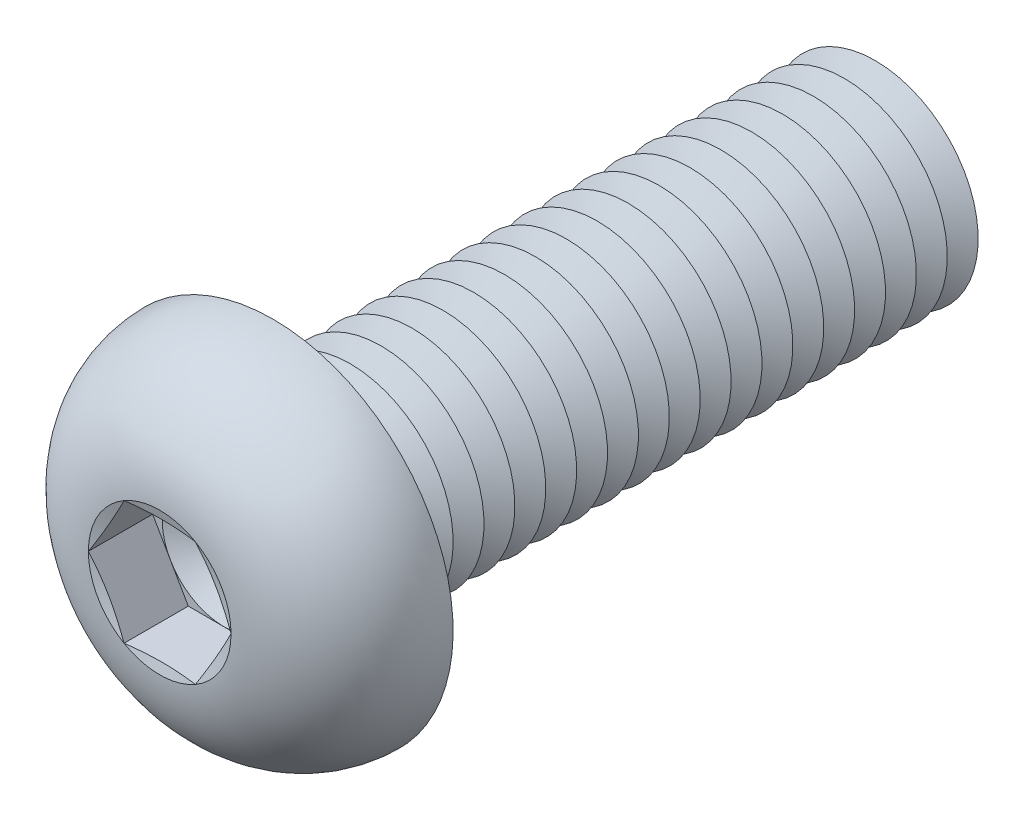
ISO-10303-21;
HEADER;
FILE_DESCRIPTION(('STEP AP214'),'2;1');
FILE_NAME('part.step','',(''),(''),'','','');
FILE_SCHEMA(('AUTOMOTIVE_DESIGN { 1 0 10303 214 1 1 1 1 }'));
ENDSEC;
DATA;
#1=APPLICATION_CONTEXT('core data for automotive mechanical design processes');
#2=APPLICATION_PROTOCOL_DEFINITION('international standard','automotive_design',2000,#1);
#3=PRODUCT_CONTEXT('',#1,'mechanical');
#4=PRODUCT('Part','Part','',(#3));
#5=PRODUCT_RELATED_PRODUCT_CATEGORY('part','',(#4));
#6=PRODUCT_DEFINITION_FORMATION('','',#4);
#7=PRODUCT_DEFINITION_CONTEXT('part definition',#1,'design');
#8=PRODUCT_DEFINITION('design','',#6,#7);
#9=PRODUCT_DEFINITION_SHAPE('','',#8);
#10=(LENGTH_UNIT() NAMED_UNIT(*) SI_UNIT(.MILLI.,.METRE.));
#11=(NAMED_UNIT(*) PLANE_ANGLE_UNIT() SI_UNIT($,.RADIAN.));
#12=(NAMED_UNIT(*) SI_UNIT($,.STERADIAN.) SOLID_ANGLE_UNIT());
#13=UNCERTAINTY_MEASURE_WITH_UNIT(LENGTH_MEASURE(1.E-05),#10,'distance_accuracy_value','');
#14=(GEOMETRIC_REPRESENTATION_CONTEXT(3) GLOBAL_UNCERTAINTY_ASSIGNED_CONTEXT((#13)) GLOBAL_UNIT_ASSIGNED_CONTEXT((#10,
#11,#12)) REPRESENTATION_CONTEXT('',''));
#15=CARTESIAN_POINT('',(0.,0.,0.));
#16=DIRECTION('',(0.,0.,1.));
#17=DIRECTION('',(1.,0.,0.));
#18=AXIS2_PLACEMENT_3D('',#15,#16,#17);
#19=CARTESIAN_POINT('',(0.,0.,2.38));
#20=DIRECTION('',(0.,0.,1.));
#21=DIRECTION('',(1.,0.,0.));
#22=AXIS2_PLACEMENT_3D('',#19,#20,#21);
#23=PLANE('',#22);
#24=CARTESIAN_POINT('',(0.,0.,2.38));
#25=DIRECTION('',(0.,0.,1.));
#26=DIRECTION('',(1.,0.,0.));
#27=AXIS2_PLACEMENT_3D('',#24,#25,#26);
#28=CIRCLE('',#27,2.99999860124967);
#29=CARTESIAN_POINT('',(2.598075,1.49999930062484,2.38));
#30=VERTEX_POINT('',#29);
#31=CARTESIAN_POINT('',(0.,2.99999860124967,2.38));
#32=VERTEX_POINT('',#31);
#33=EDGE_CURVE('E118',#30,#32,#28,.T.);
#34=ORIENTED_EDGE('',*,*,#33,.F.);
#35=DIRECTION('',(-0.500000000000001,0.866025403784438,0.));
#36=VECTOR('',#35,1.);
#37=CARTESIAN_POINT('',(3.4641,0.,2.38));
#38=LINE('',#37,#36);
#39=CARTESIAN_POINT('',(1.73205,2.99999860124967,2.38));
#40=VERTEX_POINT('',#39);
#41=EDGE_CURVE('E125',#30,#40,#38,.T.);
#42=ORIENTED_EDGE('',*,*,#41,.T.);
#43=DIRECTION('',(-1.,0.,0.));
#44=VECTOR('',#43,1.);
#45=CARTESIAN_POINT('',(1.73205,2.99999860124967,2.38));
#46=LINE('',#45,#44);
#47=EDGE_CURVE('E136',#40,#32,#46,.T.);
#48=ORIENTED_EDGE('',*,*,#47,.T.);
#49=EDGE_LOOP('',(#34,#42,#48));
#50=FACE_BOUND('',#49,.T.);
#51=ADVANCED_FACE('F39',(#50),#23,.T.);
#52=CARTESIAN_POINT('',(0.,0.,2.38));
#53=DIRECTION('',(0.,0.,1.));
#54=DIRECTION('',(1.,0.,0.));
#55=AXIS2_PLACEMENT_3D('',#52,#53,#54);
#56=CIRCLE('',#55,2.99999860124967);
#57=CARTESIAN_POINT('',(-2.598075,1.49999930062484,2.38));
#58=VERTEX_POINT('',#57);
#59=EDGE_CURVE('E11',#32,#58,#56,.T.);
#60=ORIENTED_EDGE('',*,*,#59,.F.);
#61=CARTESIAN_POINT('',(-1.73205,2.99999860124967,2.38));
#62=VERTEX_POINT('',#61);
#63=EDGE_CURVE('E131',#32,#62,#46,.T.);
#64=ORIENTED_EDGE('',*,*,#63,.T.);
#65=DIRECTION('',(-0.5,-0.866025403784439,0.));
#66=VECTOR('',#65,1.);
#67=CARTESIAN_POINT('',(-1.73205,2.99999860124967,2.38));
#68=LINE('',#67,#66);
#69=EDGE_CURVE('E134',#62,#58,#68,.T.);
#70=ORIENTED_EDGE('',*,*,#69,.T.);
#71=EDGE_LOOP('',(#60,#64,#70));
#72=FACE_BOUND('',#71,.T.);
#73=ADVANCED_FACE('F130',(#72),#23,.T.);
#74=CARTESIAN_POINT('',(-2.598075,-1.49999930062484,2.38));
#75=VERTEX_POINT('',#74);
#76=EDGE_CURVE('E49',#58,#75,#56,.T.);
#77=ORIENTED_EDGE('',*,*,#76,.F.);
#78=CARTESIAN_POINT('',(-3.4641,0.,2.38));
#79=VERTEX_POINT('',#78);
#80=EDGE_CURVE('E143',#58,#79,#68,.T.);
#81=ORIENTED_EDGE('',*,*,#80,.T.);
#82=DIRECTION('',(0.5,-0.866025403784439,0.));
#83=VECTOR('',#82,1.);
#84=CARTESIAN_POINT('',(-3.4641,0.,2.38));
#85=LINE('',#84,#83);
#86=EDGE_CURVE('E152',#79,#75,#85,.T.);
#87=ORIENTED_EDGE('',*,*,#86,.T.);
#88=EDGE_LOOP('',(#77,#81,#87));
#89=FACE_BOUND('',#88,.T.);
#90=ADVANCED_FACE('F453',(#89),#23,.T.);
#91=CARTESIAN_POINT('',(0.,-2.99999860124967,2.38));
#92=VERTEX_POINT('',#91);
#93=EDGE_CURVE('E356',#75,#92,#56,.T.);
#94=ORIENTED_EDGE('',*,*,#93,.F.);
#95=CARTESIAN_POINT('',(-1.73205,-2.99999860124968,2.38));
#96=VERTEX_POINT('',#95);
#97=EDGE_CURVE('E151',#75,#96,#85,.T.);
#98=ORIENTED_EDGE('',*,*,#97,.T.);
#99=DIRECTION('',(1.,0.,0.));
#100=VECTOR('',#99,1.);
#101=CARTESIAN_POINT('',(-1.73205,-2.99999860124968,2.38));
#102=LINE('',#101,#100);
#103=EDGE_CURVE('E157',#96,#92,#102,.T.);
#104=ORIENTED_EDGE('',*,*,#103,.T.);
#105=EDGE_LOOP('',(#94,#98,#104));
#106=FACE_BOUND('',#105,.T.);
#107=ADVANCED_FACE('F460',(#106),#23,.T.);
#108=CARTESIAN_POINT('',(2.598075,-1.49999930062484,2.38));
#109=VERTEX_POINT('',#108);
#110=EDGE_CURVE('E56',#92,#109,#56,.T.);
#111=ORIENTED_EDGE('',*,*,#110,.F.);
#112=CARTESIAN_POINT('',(1.73205,-2.99999860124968,2.38));
#113=VERTEX_POINT('',#112);
#114=EDGE_CURVE('E156',#92,#113,#102,.T.);
#115=ORIENTED_EDGE('',*,*,#114,.T.);
#116=DIRECTION('',(0.5,0.866025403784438,0.));
#117=VECTOR('',#116,1.);
#118=CARTESIAN_POINT('',(1.73205,-2.99999860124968,2.38));
#119=LINE('',#118,#117);
#120=EDGE_CURVE('E162',#113,#109,#119,.T.);
#121=ORIENTED_EDGE('',*,*,#120,.T.);
#122=EDGE_LOOP('',(#111,#115,#121));
#123=FACE_BOUND('',#122,.T.);
#124=ADVANCED_FACE('F456',(#123),#23,.T.);
#125=CARTESIAN_POINT('',(0.,0.,5.5));
#126=DIRECTION('',(0.,0.,1.));
#127=DIRECTION('',(0.,-1.,0.));
#128=AXIS2_PLACEMENT_3D('',#125,#126,#127);
#129=CONICAL_SURFACE('',#128,3.4641,1.30899693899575);
#130=CARTESIAN_POINT('',(3.46421547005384,-0.000200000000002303,5.50003094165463));
#131=CARTESIAN_POINT('',(3.39227822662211,0.124398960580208,5.48074619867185));
#132=CARTESIAN_POINT('',(3.32021054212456,0.249223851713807,5.46323875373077));
#133=CARTESIAN_POINT('',(3.17582062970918,0.499314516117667,5.43247971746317));
#134=CARTESIAN_POINT('',(3.10349831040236,0.624580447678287,5.41922985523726));
#135=CARTESIAN_POINT('',(2.95903767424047,0.874793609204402,5.39775958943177));
#136=CARTESIAN_POINT('',(2.88690033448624,0.999739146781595,5.38951357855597));
#137=CARTESIAN_POINT('',(2.74253364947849,1.2497895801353,5.37845651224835));
#138=CARTESIAN_POINT('',(2.67030432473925,1.37489444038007,5.37564440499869));
#139=CARTESIAN_POINT('',(2.52584567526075,1.6251041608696,5.37564440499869));
#140=CARTESIAN_POINT('',(2.45361635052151,1.75020902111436,5.37845651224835));
#141=CARTESIAN_POINT('',(2.30924966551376,2.00025945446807,5.38951357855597));
#142=CARTESIAN_POINT('',(2.23711232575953,2.12520499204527,5.39775958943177));
#143=CARTESIAN_POINT('',(2.09265168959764,2.37541815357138,5.41922985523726));
#144=CARTESIAN_POINT('',(2.02032937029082,2.500684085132,5.43247971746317));
#145=CARTESIAN_POINT('',(1.87593945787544,2.75077474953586,5.46323875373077));
#146=CARTESIAN_POINT('',(1.80387177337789,2.87559964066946,5.48074619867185));
#147=CARTESIAN_POINT('',(1.73193452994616,3.00019860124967,5.50003094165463));
#148=B_SPLINE_CURVE_WITH_KNOTS('',3,(#130,#131,#132,#133,#134,#135,#136,#137,#138,#139,#140,
#141,#142,#143,#144,#145,#146,#147),.UNSPECIFIED.,.F.,.F.,(4,2,2,2,2,2,2,2,4),(0.,
0.435506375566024,0.871189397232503,1.3046235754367,1.7379738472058,2.1713241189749,
2.6047582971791,3.04044131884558,3.4759476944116),.UNSPECIFIED.);
#149=CARTESIAN_POINT('',(3.4641,0.,5.5));
#150=VERTEX_POINT('',#149);
#151=CARTESIAN_POINT('',(1.73204999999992,2.99999860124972,5.5));
#152=VERTEX_POINT('',#151);
#153=EDGE_CURVE('E228',#150,#152,#148,.T.);
#154=ORIENTED_EDGE('',*,*,#153,.F.);
#155=CARTESIAN_POINT('',(0.,0.,5.5));
#156=DIRECTION('',(0.,0.,-1.));
#157=DIRECTION('',(0.,1.,0.));
#158=AXIS2_PLACEMENT_3D('',#155,#156,#157);
#159=CIRCLE('',#158,3.4641);
#160=EDGE_CURVE('E308',#152,#150,#159,.T.);
#161=ORIENTED_EDGE('',*,*,#160,.F.);
#162=EDGE_LOOP('',(#154,#161));
#163=FACE_BOUND('',#162,.T.);
#164=ADVANCED_FACE('F447',(#163),#129,.F.);
#165=CARTESIAN_POINT('',(1.73193452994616,-3.00019860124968,5.50003094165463));
#166=CARTESIAN_POINT('',(1.80387177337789,-2.87559964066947,5.48074619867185));
#167=CARTESIAN_POINT('',(1.87593945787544,-2.75077474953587,5.46323875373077));
#168=CARTESIAN_POINT('',(2.02032937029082,-2.50068408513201,5.43247971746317));
#169=CARTESIAN_POINT('',(2.09265168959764,-2.37541815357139,5.41922985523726));
#170=CARTESIAN_POINT('',(2.23711232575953,-2.12520499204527,5.39775958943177));
#171=CARTESIAN_POINT('',(2.30924966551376,-2.00025945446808,5.38951357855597));
#172=CARTESIAN_POINT('',(2.45361635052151,-1.75020902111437,5.37845651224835));
#173=CARTESIAN_POINT('',(2.52584567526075,-1.6251041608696,5.37564440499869));
#174=CARTESIAN_POINT('',(2.67030432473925,-1.37489444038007,5.37564440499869));
#175=CARTESIAN_POINT('',(2.74253364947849,-1.24978958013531,5.37845651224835));
#176=CARTESIAN_POINT('',(2.88690033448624,-0.999739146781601,5.38951357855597));
#177=CARTESIAN_POINT('',(2.95903767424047,-0.874793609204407,5.39775958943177));
#178=CARTESIAN_POINT('',(3.10349831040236,-0.624580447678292,5.41922985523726));
#179=CARTESIAN_POINT('',(3.17582062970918,-0.499314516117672,5.43247971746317));
#180=CARTESIAN_POINT('',(3.32021054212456,-0.249223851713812,5.46323875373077));
#181=CARTESIAN_POINT('',(3.39227822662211,-0.124398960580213,5.48074619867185));
#182=CARTESIAN_POINT('',(3.46421547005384,0.000199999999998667,5.50003094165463));
#183=B_SPLINE_CURVE_WITH_KNOTS('',3,(#165,#166,#167,#168,#169,#170,#171,#172,#173,#174,#175,
#176,#177,#178,#179,#180,#181,#182),.UNSPECIFIED.,.F.,.F.,(4,2,2,2,2,2,2,2,4),(0.,
0.435506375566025,0.871189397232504,1.3046235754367,1.7379738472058,2.1713241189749,
2.6047582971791,3.04044131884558,3.4759476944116),.UNSPECIFIED.);
#184=CARTESIAN_POINT('',(1.73205,-2.99999860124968,5.5));
#185=VERTEX_POINT('',#184);
#186=EDGE_CURVE('E231',#185,#150,#183,.T.);
#187=ORIENTED_EDGE('',*,*,#186,.F.);
#188=EDGE_CURVE('E291',#150,#185,#159,.T.);
#189=ORIENTED_EDGE('',*,*,#188,.F.);
#190=EDGE_LOOP('',(#187,#189));
#191=FACE_BOUND('',#190,.T.);
#192=ADVANCED_FACE('F289',(#191),#129,.F.);
#193=CARTESIAN_POINT('',(-5.2273006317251,-2.99999860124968,6.18672552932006));
#194=CARTESIAN_POINT('',(-5.10075887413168,-2.99999860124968,6.1573201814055));
#195=CARTESIAN_POINT('',(-4.97415993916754,-2.99999860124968,6.12816064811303));
#196=CARTESIAN_POINT('',(-4.72082394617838,-2.99999860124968,6.07043857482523));
#197=CARTESIAN_POINT('',(-4.59408688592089,-2.99999860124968,6.04187604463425));
#198=CARTESIAN_POINT('',(-4.21358997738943,-2.99999860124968,5.95723252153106));
#199=CARTESIAN_POINT('',(-3.95959339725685,-2.99999860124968,5.90220706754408));
#200=CARTESIAN_POINT('',(-3.44835573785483,-2.99999860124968,5.79574115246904));
#201=CARTESIAN_POINT('',(-3.19110656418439,-2.99999860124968,5.744339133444));
#202=CARTESIAN_POINT('',(-2.67540790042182,-2.99999860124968,5.64772994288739));
#203=CARTESIAN_POINT('',(-2.41695830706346,-2.99999860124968,5.60252331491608));
#204=CARTESIAN_POINT('',(-1.9055512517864,-2.99999860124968,5.52251897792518));
#205=CARTESIAN_POINT('',(-1.65263426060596,-2.99999860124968,5.48747285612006));
#206=CARTESIAN_POINT('',(-1.27220564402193,-2.99999860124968,5.44439602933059));
#207=CARTESIAN_POINT('',(-1.1452320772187,-2.99999860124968,5.43161987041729));
#208=CARTESIAN_POINT('',(-0.890973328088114,-2.99999860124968,5.40972605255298));
#209=CARTESIAN_POINT('',(-0.763688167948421,-2.99999860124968,5.40060814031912));
#210=CARTESIAN_POINT('',(-0.509442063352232,-2.99999860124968,5.38647457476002));
#211=CARTESIAN_POINT('',(-0.382482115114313,-2.99999860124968,5.38144125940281));
#212=CARTESIAN_POINT('',(-0.128463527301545,-2.99999860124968,5.37566637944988));
#213=CARTESIAN_POINT('',(-0.00140488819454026,-2.99999860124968,5.37492479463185));
#214=CARTESIAN_POINT('',(0.252672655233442,-2.99999860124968,5.37777315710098));
#215=CARTESIAN_POINT('',(0.379691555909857,-2.99999860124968,5.38136342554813));
#216=CARTESIAN_POINT('',(0.633540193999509,-2.99999860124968,5.39268816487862));
#217=CARTESIAN_POINT('',(0.76036993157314,-2.99999860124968,5.40042263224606));
#218=CARTESIAN_POINT('',(1.06836981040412,-2.99999860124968,5.42382465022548));
#219=CARTESIAN_POINT('',(1.24938929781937,-2.99999860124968,5.4414748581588));
#220=CARTESIAN_POINT('',(1.61066786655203,-2.99999860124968,5.48312309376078));
#221=CARTESIAN_POINT('',(1.7909269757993,-2.99999860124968,5.50712088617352));
#222=CARTESIAN_POINT('',(2.15127612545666,-2.99999860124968,5.56013471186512));
#223=CARTESIAN_POINT('',(2.33136383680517,-2.99999860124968,5.58916634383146));
#224=CARTESIAN_POINT('',(2.690892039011,-2.99999860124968,5.65100028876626));
#225=CARTESIAN_POINT('',(2.87033249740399,-2.99999860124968,5.6838027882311));
#226=CARTESIAN_POINT('',(3.23235399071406,-2.99999860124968,5.75295369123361));
#227=CARTESIAN_POINT('',(3.4149236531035,-2.99999860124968,5.78936117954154));
#228=CARTESIAN_POINT('',(3.77960351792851,-2.99999860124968,5.86440648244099));
#229=CARTESIAN_POINT('',(3.96171371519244,-2.99999860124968,5.903044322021));
#230=CARTESIAN_POINT('',(4.32457472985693,-2.99999860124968,5.98179660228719));
#231=CARTESIAN_POINT('',(4.5053275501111,-2.99999860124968,6.02190185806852));
#232=CARTESIAN_POINT('',(4.86652484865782,-2.99999860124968,6.10342152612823));
#233=CARTESIAN_POINT('',(5.04696934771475,-2.99999860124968,6.14483584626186));
#234=CARTESIAN_POINT('',(5.2273006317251,-2.99999860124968,6.18672552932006));
#235=B_SPLINE_CURVE_WITH_KNOTS('',3,(#193,#194,#195,#196,#197,#198,#199,#200,#201,#202,#203,
#204,#205,#206,#207,#208,#209,#210,#211,#212,#213,#214,#215,#216,#217,#218,#219,#220,#221,#222,
#223,#224,#225,#226,#227,#228,#229,#230,#231,#232,#233,#234),.UNSPECIFIED.,.F.,.F.,(4,2,2,2,2,2,
2,2,2,2,2,2,2,2,2,2,2,2,2,2,4),(0.,0.389739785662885,0.779485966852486,1.5591292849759,
2.34608117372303,3.13310206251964,3.8988410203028,4.28164148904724,4.66441544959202,
5.04552531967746,5.42663339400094,5.80776972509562,6.18890573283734,6.73438998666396,
7.27985402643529,7.8270395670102,8.37425218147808,8.93272720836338,9.49120849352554,
10.0466490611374,10.6020506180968),.UNSPECIFIED.);
#236=CARTESIAN_POINT('',(-1.73205,-2.99999860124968,5.5));
#237=VERTEX_POINT('',#236);
#238=EDGE_CURVE('E241',#237,#185,#235,.T.);
#239=ORIENTED_EDGE('',*,*,#238,.F.);
#240=EDGE_CURVE('E296',#185,#237,#159,.T.);
#241=ORIENTED_EDGE('',*,*,#240,.F.);
#242=EDGE_LOOP('',(#239,#241));
#243=FACE_BOUND('',#242,.T.);
#244=ADVANCED_FACE('F297',(#243),#129,.F.);
#245=CARTESIAN_POINT('',(-3.46421547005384,0.000199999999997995,5.50003094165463));
#246=CARTESIAN_POINT('',(-3.39227822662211,-0.124398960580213,5.48074619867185));
#247=CARTESIAN_POINT('',(-3.32021054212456,-0.249223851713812,5.46323875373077));
#248=CARTESIAN_POINT('',(-3.17582062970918,-0.499314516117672,5.43247971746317));
#249=CARTESIAN_POINT('',(-3.10349831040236,-0.624580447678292,5.41922985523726));
#250=CARTESIAN_POINT('',(-2.95903767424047,-0.874793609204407,5.39775958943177));
#251=CARTESIAN_POINT('',(-2.88690033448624,-0.999739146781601,5.38951357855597));
#252=CARTESIAN_POINT('',(-2.74253364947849,-1.24978958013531,5.37845651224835));
#253=CARTESIAN_POINT('',(-2.67030432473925,-1.37489444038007,5.37564440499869));
#254=CARTESIAN_POINT('',(-2.52584567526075,-1.6251041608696,5.37564440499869));
#255=CARTESIAN_POINT('',(-2.45361635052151,-1.75020902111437,5.37845651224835));
#256=CARTESIAN_POINT('',(-2.30924966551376,-2.00025945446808,5.38951357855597));
#257=CARTESIAN_POINT('',(-2.23711232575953,-2.12520499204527,5.39775958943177));
#258=CARTESIAN_POINT('',(-2.09265168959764,-2.37541815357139,5.41922985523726));
#259=CARTESIAN_POINT('',(-2.02032937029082,-2.50068408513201,5.43247971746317));
#260=CARTESIAN_POINT('',(-1.87593945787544,-2.75077474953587,5.46323875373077));
#261=CARTESIAN_POINT('',(-1.80387177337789,-2.87559964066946,5.48074619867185));
#262=CARTESIAN_POINT('',(-1.73193452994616,-3.00019860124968,5.50003094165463));
#263=B_SPLINE_CURVE_WITH_KNOTS('',3,(#245,#246,#247,#248,#249,#250,#251,#252,#253,#254,#255,
#256,#257,#258,#259,#260,#261,#262),.UNSPECIFIED.,.F.,.F.,(4,2,2,2,2,2,2,2,4),(0.,
0.435506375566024,0.871189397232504,1.3046235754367,1.7379738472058,2.1713241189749,
2.6047582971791,3.04044131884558,3.4759476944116),.UNSPECIFIED.);
#264=CARTESIAN_POINT('',(-3.4641,0.,5.5));
#265=VERTEX_POINT('',#264);
#266=EDGE_CURVE('E236',#265,#237,#263,.T.);
#267=ORIENTED_EDGE('',*,*,#266,.F.);
#268=EDGE_CURVE('E302',#237,#265,#159,.T.);
#269=ORIENTED_EDGE('',*,*,#268,.F.);
#270=EDGE_LOOP('',(#267,#269));
#271=FACE_BOUND('',#270,.T.);
#272=ADVANCED_FACE('F1021',(#271),#129,.F.);
#273=CARTESIAN_POINT('',(-1.73193452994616,3.00019860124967,5.50003094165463));
#274=CARTESIAN_POINT('',(-1.8038717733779,2.87559964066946,5.48074619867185));
#275=CARTESIAN_POINT('',(-1.87593945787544,2.75077474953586,5.46323875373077));
#276=CARTESIAN_POINT('',(-2.02032937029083,2.500684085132,5.43247971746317));
#277=CARTESIAN_POINT('',(-2.09265168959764,2.37541815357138,5.41922985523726));
#278=CARTESIAN_POINT('',(-2.23711232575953,2.12520499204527,5.39775958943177));
#279=CARTESIAN_POINT('',(-2.30924966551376,2.00025945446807,5.38951357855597));
#280=CARTESIAN_POINT('',(-2.45361635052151,1.75020902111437,5.37845651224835));
#281=CARTESIAN_POINT('',(-2.52584567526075,1.6251041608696,5.37564440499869));
#282=CARTESIAN_POINT('',(-2.67030432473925,1.37489444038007,5.37564440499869));
#283=CARTESIAN_POINT('',(-2.74253364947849,1.2497895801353,5.37845651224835));
#284=CARTESIAN_POINT('',(-2.88690033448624,0.999739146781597,5.38951357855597));
#285=CARTESIAN_POINT('',(-2.95903767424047,0.874793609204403,5.39775958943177));
#286=CARTESIAN_POINT('',(-3.10349831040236,0.624580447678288,5.41922985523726));
#287=CARTESIAN_POINT('',(-3.17582062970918,0.499314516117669,5.43247971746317));
#288=CARTESIAN_POINT('',(-3.32021054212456,0.249223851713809,5.46323875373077));
#289=CARTESIAN_POINT('',(-3.39227822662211,0.12439896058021,5.48074619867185));
#290=CARTESIAN_POINT('',(-3.46421547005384,-0.000200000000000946,5.50003094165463));
#291=B_SPLINE_CURVE_WITH_KNOTS('',3,(#273,#274,#275,#276,#277,#278,#279,#280,#281,#282,#283,
#284,#285,#286,#287,#288,#289,#290),.UNSPECIFIED.,.F.,.F.,(4,2,2,2,2,2,2,2,4),(0.,
0.435506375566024,0.871189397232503,1.3046235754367,1.7379738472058,2.1713241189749,
2.6047582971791,3.04044131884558,3.4759476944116),.UNSPECIFIED.);
#292=CARTESIAN_POINT('',(-1.73205,2.99999860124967,5.5));
#293=VERTEX_POINT('',#292);
#294=EDGE_CURVE('E233',#293,#265,#291,.T.);
#295=ORIENTED_EDGE('',*,*,#294,.F.);
#296=EDGE_CURVE('E321',#265,#293,#159,.T.);
#297=ORIENTED_EDGE('',*,*,#296,.F.);
#298=EDGE_LOOP('',(#295,#297));
#299=FACE_BOUND('',#298,.T.);
#300=ADVANCED_FACE('F448',(#299),#129,.F.);
#301=CARTESIAN_POINT('',(0.,0.,-24.75));
#302=DIRECTION('',(0.,0.,1.));
#303=DIRECTION('',(0.,-1.,0.));
#304=AXIS2_PLACEMENT_3D('',#301,#302,#303);
#305=CONICAL_SURFACE('',#304,4.99999999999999,1.0471975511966);
#306=CARTESIAN_POINT('',(0.,0.,-25.5));
#307=DIRECTION('',(0.,0.,1.));
#308=DIRECTION('',(0.,-1.,0.));
#309=AXIS2_PLACEMENT_3D('',#306,#307,#308);
#310=CIRCLE('',#309,3.70096189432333);
#311=CARTESIAN_POINT('',(0.,-3.70096189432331,-25.5));
#312=VERTEX_POINT('',#311);
#313=EDGE_CURVE('E408',#312,#312,#310,.T.);
#314=ORIENTED_EDGE('',*,*,#313,.T.);
#315=EDGE_LOOP('',(#314));
#316=FACE_BOUND('',#315,.T.);
#317=CARTESIAN_POINT('',(0.,0.,-24.75));
#318=DIRECTION('',(0.,0.,1.));
#319=DIRECTION('',(0.,-1.,0.));
#320=AXIS2_PLACEMENT_3D('',#317,#318,#319);
#321=CIRCLE('',#320,4.99999999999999);
#322=CARTESIAN_POINT('',(0.,-4.99999999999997,-24.75));
#323=VERTEX_POINT('',#322);
#324=EDGE_CURVE('E364',#323,#323,#321,.T.);
#325=ORIENTED_EDGE('',*,*,#324,.F.);
#326=EDGE_LOOP('',(#325));
#327=FACE_BOUND('',#326,.T.);
#328=ADVANCED_FACE('F610',(#316,#327),#305,.T.);
#329=CARTESIAN_POINT('',(0.,0.,-25.5));
#330=DIRECTION('',(0.,0.,-1.));
#331=DIRECTION('',(0.,1.,0.));
#332=AXIS2_PLACEMENT_3D('',#329,#330,#331);
#333=CONICAL_SURFACE('',#332,3.70096189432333,1.0471975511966);
#334=CARTESIAN_POINT('',(0.,0.,-26.25));
#335=DIRECTION('',(0.,0.,1.));
#336=DIRECTION('',(0.,-1.,0.));
#337=AXIS2_PLACEMENT_3D('',#334,#335,#336);
#338=CIRCLE('',#337,4.99999999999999);
#339=CARTESIAN_POINT('',(0.,-4.99999999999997,-26.25));
#340=VERTEX_POINT('',#339);
#341=EDGE_CURVE('E412',#340,#340,#338,.T.);
#342=ORIENTED_EDGE('',*,*,#341,.T.);
#343=EDGE_LOOP('',(#342));
#344=FACE_BOUND('',#343,.T.);
#345=ORIENTED_EDGE('',*,*,#313,.F.);
#346=EDGE_LOOP('',(#345));
#347=FACE_BOUND('',#346,.T.);
#348=ADVANCED_FACE('F606',(#344,#347),#333,.T.);
#349=CARTESIAN_POINT('',(0.,5.,-30.));
#350=DIRECTION('',(0.,0.,-1.));
#351=DIRECTION('',(0.,1.,0.));
#352=AXIS2_PLACEMENT_3D('',#349,#350,#351);
#353=PLANE('',#352);
#354=CARTESIAN_POINT('',(0.,0.,-30.));
#355=DIRECTION('',(0.,0.,1.));
#356=DIRECTION('',(0.,-1.,0.));
#357=AXIS2_PLACEMENT_3D('',#354,#355,#356);
#358=CIRCLE('',#357,3.70096189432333);
#359=CARTESIAN_POINT('',(0.,-3.70096189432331,-30.));
#360=VERTEX_POINT('',#359);
#361=EDGE_CURVE('E328',#360,#360,#358,.T.);
#362=ORIENTED_EDGE('',*,*,#361,.F.);
#363=EDGE_LOOP('',(#362));
#364=FACE_BOUND('',#363,.T.);
#365=ADVANCED_FACE('F609',(#364),#353,.T.);
#366=CARTESIAN_POINT('',(0.,0.,-29.25));
#367=DIRECTION('',(0.,0.,1.));
#368=DIRECTION('',(0.,-1.,0.));
#369=AXIS2_PLACEMENT_3D('',#366,#367,#368);
#370=CONICAL_SURFACE('',#369,4.99999999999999,1.0471975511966);
#371=ORIENTED_EDGE('',*,*,#361,.T.);
#372=EDGE_LOOP('',(#371));
#373=FACE_BOUND('',#372,.T.);
#374=CARTESIAN_POINT('',(0.,0.,-29.25));
#375=DIRECTION('',(0.,0.,1.));
#376=DIRECTION('',(0.,-1.,0.));
#377=AXIS2_PLACEMENT_3D('',#374,#375,#376);
#378=CIRCLE('',#377,4.99999999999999);
#379=CARTESIAN_POINT('',(0.,-4.99999999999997,-29.25));
#380=VERTEX_POINT('',#379);
#381=EDGE_CURVE('E428',#380,#380,#378,.T.);
#382=ORIENTED_EDGE('',*,*,#381,.F.);
#383=EDGE_LOOP('',(#382));
#384=FACE_BOUND('',#383,.T.);
#385=ADVANCED_FACE('F626',(#373,#384),#370,.T.);
#386=CARTESIAN_POINT('',(0.,0.,-28.5));
#387=DIRECTION('',(0.,0.,-1.));
#388=DIRECTION('',(0.,1.,0.));
#389=AXIS2_PLACEMENT_3D('',#386,#387,#388);
#390=CONICAL_SURFACE('',#389,3.70096189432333,1.0471975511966);
#391=ORIENTED_EDGE('',*,*,#381,.T.);
#392=EDGE_LOOP('',(#391));
#393=FACE_BOUND('',#392,.T.);
#394=CARTESIAN_POINT('',(0.,0.,-28.5));
#395=DIRECTION('',(0.,0.,1.));
#396=DIRECTION('',(0.,-1.,0.));
#397=AXIS2_PLACEMENT_3D('',#394,#395,#396);
#398=CIRCLE('',#397,3.70096189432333);
#399=CARTESIAN_POINT('',(0.,-3.70096189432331,-28.5));
#400=VERTEX_POINT('',#399);
#401=EDGE_CURVE('E424',#400,#400,#398,.T.);
#402=ORIENTED_EDGE('',*,*,#401,.F.);
#403=EDGE_LOOP('',(#402));
#404=FACE_BOUND('',#403,.T.);
#405=ADVANCED_FACE('F623',(#393,#404),#390,.T.);
#406=CARTESIAN_POINT('',(0.,0.,-27.75));
#407=DIRECTION('',(0.,0.,1.));
#408=DIRECTION('',(0.,-1.,0.));
#409=AXIS2_PLACEMENT_3D('',#406,#407,#408);
#410=CONICAL_SURFACE('',#409,4.99999999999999,1.0471975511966);
#411=ORIENTED_EDGE('',*,*,#401,.T.);
#412=EDGE_LOOP('',(#411));
#413=FACE_BOUND('',#412,.T.);
#414=CARTESIAN_POINT('',(0.,0.,-27.75));
#415=DIRECTION('',(0.,0.,1.));
#416=DIRECTION('',(0.,-1.,0.));
#417=AXIS2_PLACEMENT_3D('',#414,#415,#416);
#418=CIRCLE('',#417,4.99999999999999);
#419=CARTESIAN_POINT('',(0.,-4.99999999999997,-27.75));
#420=VERTEX_POINT('',#419);
#421=EDGE_CURVE('E420',#420,#420,#418,.T.);
#422=ORIENTED_EDGE('',*,*,#421,.F.);
#423=EDGE_LOOP('',(#422));
#424=FACE_BOUND('',#423,.T.);
#425=ADVANCED_FACE('F618',(#413,#424),#410,.T.);
#426=CARTESIAN_POINT('',(0.,0.,-27.));
#427=DIRECTION('',(0.,0.,-1.));
#428=DIRECTION('',(0.,1.,0.));
#429=AXIS2_PLACEMENT_3D('',#426,#427,#428);
#430=CONICAL_SURFACE('',#429,3.70096189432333,1.0471975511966);
#431=ORIENTED_EDGE('',*,*,#421,.T.);
#432=EDGE_LOOP('',(#431));
#433=FACE_BOUND('',#432,.T.);
#434=CARTESIAN_POINT('',(0.,0.,-27.));
#435=DIRECTION('',(0.,0.,1.));
#436=DIRECTION('',(0.,-1.,0.));
#437=AXIS2_PLACEMENT_3D('',#434,#435,#436);
#438=CIRCLE('',#437,3.70096189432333);
#439=CARTESIAN_POINT('',(0.,-3.70096189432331,-27.));
#440=VERTEX_POINT('',#439);
#441=EDGE_CURVE('E416',#440,#440,#438,.T.);
#442=ORIENTED_EDGE('',*,*,#441,.F.);
#443=EDGE_LOOP('',(#442));
#444=FACE_BOUND('',#443,.T.);
#445=ADVANCED_FACE('F615',(#433,#444),#430,.T.);
#446=CARTESIAN_POINT('',(0.,0.,-26.25));
#447=DIRECTION('',(0.,0.,1.));
#448=DIRECTION('',(0.,-1.,0.));
#449=AXIS2_PLACEMENT_3D('',#446,#447,#448);
#450=CONICAL_SURFACE('',#449,4.99999999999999,1.0471975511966);
#451=ORIENTED_EDGE('',*,*,#441,.T.);
#452=EDGE_LOOP('',(#451));
#453=FACE_BOUND('',#452,.T.);
#454=ORIENTED_EDGE('',*,*,#341,.F.);
#455=EDGE_LOOP('',(#454));
#456=FACE_BOUND('',#455,.T.);
#457=ADVANCED_FACE('F604',(#453,#456),#450,.T.);
#458=CARTESIAN_POINT('',(0.,0.,-23.25));
#459=DIRECTION('',(0.,0.,1.));
#460=DIRECTION('',(0.,-1.,0.));
#461=AXIS2_PLACEMENT_3D('',#458,#459,#460);
#462=CONICAL_SURFACE('',#461,4.99999999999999,1.0471975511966);
#463=CARTESIAN_POINT('',(0.,0.,-24.));
#464=DIRECTION('',(0.,0.,1.));
#465=DIRECTION('',(0.,-1.,0.));
#466=AXIS2_PLACEMENT_3D('',#463,#464,#465);
#467=CIRCLE('',#466,3.70096189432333);
#468=CARTESIAN_POINT('',(0.,-3.70096189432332,-24.));
#469=VERTEX_POINT('',#468);
#470=EDGE_CURVE('E402',#469,#469,#467,.T.);
#471=ORIENTED_EDGE('',*,*,#470,.T.);
#472=EDGE_LOOP('',(#471));
#473=FACE_BOUND('',#472,.T.);
#474=CARTESIAN_POINT('',(0.,0.,-23.25));
#475=DIRECTION('',(0.,0.,1.));
#476=DIRECTION('',(0.,-1.,0.));
#477=AXIS2_PLACEMENT_3D('',#474,#475,#476);
#478=CIRCLE('',#477,4.99999999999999);
#479=CARTESIAN_POINT('',(0.,-4.99999999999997,-23.25));
#480=VERTEX_POINT('',#479);
#481=EDGE_CURVE('E398',#480,#480,#478,.T.);
#482=ORIENTED_EDGE('',*,*,#481,.F.);
#483=EDGE_LOOP('',(#482));
#484=FACE_BOUND('',#483,.T.);
#485=ADVANCED_FACE('F600',(#473,#484),#462,.T.);
#486=CARTESIAN_POINT('',(0.,0.,-24.));
#487=DIRECTION('',(0.,0.,-1.));
#488=DIRECTION('',(0.,1.,0.));
#489=AXIS2_PLACEMENT_3D('',#486,#487,#488);
#490=CONICAL_SURFACE('',#489,3.70096189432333,1.0471975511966);
#491=ORIENTED_EDGE('',*,*,#324,.T.);
#492=EDGE_LOOP('',(#491));
#493=FACE_BOUND('',#492,.T.);
#494=ORIENTED_EDGE('',*,*,#470,.F.);
#495=EDGE_LOOP('',(#494));
#496=FACE_BOUND('',#495,.T.);
#497=ADVANCED_FACE('F596',(#493,#496),#490,.T.);
#498=CARTESIAN_POINT('',(0.,0.,-21.75));
#499=DIRECTION('',(0.,0.,1.));
#500=DIRECTION('',(0.,-1.,0.));
#501=AXIS2_PLACEMENT_3D('',#498,#499,#500);
#502=CONICAL_SURFACE('',#501,4.99999999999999,1.0471975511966);
#503=CARTESIAN_POINT('',(0.,0.,-22.5));
#504=DIRECTION('',(0.,0.,1.));
#505=DIRECTION('',(0.,-1.,0.));
#506=AXIS2_PLACEMENT_3D('',#503,#504,#505);
#507=CIRCLE('',#506,3.70096189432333);
#508=CARTESIAN_POINT('',(0.,-3.70096189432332,-22.5));
#509=VERTEX_POINT('',#508);
#510=EDGE_CURVE('E394',#509,#509,#507,.T.);
#511=ORIENTED_EDGE('',*,*,#510,.T.);
#512=EDGE_LOOP('',(#511));
#513=FACE_BOUND('',#512,.T.);
#514=CARTESIAN_POINT('',(0.,0.,-21.75));
#515=DIRECTION('',(0.,0.,1.));
#516=DIRECTION('',(0.,-1.,0.));
#517=AXIS2_PLACEMENT_3D('',#514,#515,#516);
#518=CIRCLE('',#517,4.99999999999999);
#519=CARTESIAN_POINT('',(0.,-4.99999999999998,-21.75));
#520=VERTEX_POINT('',#519);
#521=EDGE_CURVE('E333',#520,#520,#518,.T.);
#522=ORIENTED_EDGE('',*,*,#521,.F.);
#523=EDGE_LOOP('',(#522));
#524=FACE_BOUND('',#523,.T.);
#525=ADVANCED_FACE('F592',(#513,#524),#502,.T.);
#526=CARTESIAN_POINT('',(0.,0.,-22.5));
#527=DIRECTION('',(0.,0.,-1.));
#528=DIRECTION('',(0.,1.,0.));
#529=AXIS2_PLACEMENT_3D('',#526,#527,#528);
#530=CONICAL_SURFACE('',#529,3.70096189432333,1.0471975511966);
#531=ORIENTED_EDGE('',*,*,#481,.T.);
#532=EDGE_LOOP('',(#531));
#533=FACE_BOUND('',#532,.T.);
#534=ORIENTED_EDGE('',*,*,#510,.F.);
#535=EDGE_LOOP('',(#534));
#536=FACE_BOUND('',#535,.T.);
#537=ADVANCED_FACE('F588',(#533,#536),#530,.T.);
#538=CARTESIAN_POINT('',(0.,0.,-20.25));
#539=DIRECTION('',(0.,0.,1.));
#540=DIRECTION('',(0.,-1.,0.));
#541=AXIS2_PLACEMENT_3D('',#538,#539,#540);
#542=CONICAL_SURFACE('',#541,4.99999999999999,1.0471975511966);
#543=CARTESIAN_POINT('',(0.,0.,-21.));
#544=DIRECTION('',(0.,0.,1.));
#545=DIRECTION('',(0.,-1.,0.));
#546=AXIS2_PLACEMENT_3D('',#543,#544,#545);
#547=CIRCLE('',#546,3.70096189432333);
#548=CARTESIAN_POINT('',(0.,-3.70096189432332,-21.));
#549=VERTEX_POINT('',#548);
#550=EDGE_CURVE('E345',#549,#549,#547,.T.);
#551=ORIENTED_EDGE('',*,*,#550,.T.);
#552=EDGE_LOOP('',(#551));
#553=FACE_BOUND('',#552,.T.);
#554=CARTESIAN_POINT('',(0.,0.,-20.25));
#555=DIRECTION('',(0.,0.,1.));
#556=DIRECTION('',(0.,-1.,0.));
#557=AXIS2_PLACEMENT_3D('',#554,#555,#556);
#558=CIRCLE('',#557,4.99999999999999);
#559=CARTESIAN_POINT('',(0.,-4.99999999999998,-20.25));
#560=VERTEX_POINT('',#559);
#561=EDGE_CURVE('E347',#560,#560,#558,.T.);
#562=ORIENTED_EDGE('',*,*,#561,.F.);
#563=EDGE_LOOP('',(#562));
#564=FACE_BOUND('',#563,.T.);
#565=ADVANCED_FACE('F584',(#553,#564),#542,.T.);
#566=CARTESIAN_POINT('',(0.,0.,-21.));
#567=DIRECTION('',(0.,0.,-1.));
#568=DIRECTION('',(0.,1.,0.));
#569=AXIS2_PLACEMENT_3D('',#566,#567,#568);
#570=CONICAL_SURFACE('',#569,3.70096189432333,1.0471975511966);
#571=ORIENTED_EDGE('',*,*,#521,.T.);
#572=EDGE_LOOP('',(#571));
#573=FACE_BOUND('',#572,.T.);
#574=ORIENTED_EDGE('',*,*,#550,.F.);
#575=EDGE_LOOP('',(#574));
#576=FACE_BOUND('',#575,.T.);
#577=ADVANCED_FACE('F580',(#573,#576),#570,.T.);
#578=CARTESIAN_POINT('',(0.,0.,-18.75));
#579=DIRECTION('',(0.,0.,1.));
#580=DIRECTION('',(0.,-1.,0.));
#581=AXIS2_PLACEMENT_3D('',#578,#579,#580);
#582=CONICAL_SURFACE('',#581,4.99999999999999,1.0471975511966);
#583=CARTESIAN_POINT('',(0.,0.,-19.5));
#584=DIRECTION('',(0.,0.,1.));
#585=DIRECTION('',(0.,-1.,0.));
#586=AXIS2_PLACEMENT_3D('',#583,#584,#585);
#587=CIRCLE('',#586,3.70096189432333);
#588=CARTESIAN_POINT('',(0.,-3.70096189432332,-19.5));
#589=VERTEX_POINT('',#588);
#590=EDGE_CURVE('E381',#589,#589,#587,.T.);
#591=ORIENTED_EDGE('',*,*,#590,.T.);
#592=EDGE_LOOP('',(#591));
#593=FACE_BOUND('',#592,.T.);
#594=CARTESIAN_POINT('',(0.,0.,-18.75));
#595=DIRECTION('',(0.,0.,1.));
#596=DIRECTION('',(0.,-1.,0.));
#597=AXIS2_PLACEMENT_3D('',#594,#595,#596);
#598=CIRCLE('',#597,4.99999999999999);
#599=CARTESIAN_POINT('',(0.,-4.99999999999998,-18.75));
#600=VERTEX_POINT('',#599);
#601=EDGE_CURVE('E374',#600,#600,#598,.T.);
#602=ORIENTED_EDGE('',*,*,#601,.F.);
#603=EDGE_LOOP('',(#602));
#604=FACE_BOUND('',#603,.T.);
#605=ADVANCED_FACE('F576',(#593,#604),#582,.T.);
#606=CARTESIAN_POINT('',(0.,0.,-19.5));
#607=DIRECTION('',(0.,0.,-1.));
#608=DIRECTION('',(0.,1.,0.));
#609=AXIS2_PLACEMENT_3D('',#606,#607,#608);
#610=CONICAL_SURFACE('',#609,3.70096189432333,1.0471975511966);
#611=ORIENTED_EDGE('',*,*,#561,.T.);
#612=EDGE_LOOP('',(#611));
#613=FACE_BOUND('',#612,.T.);
#614=ORIENTED_EDGE('',*,*,#590,.F.);
#615=EDGE_LOOP('',(#614));
#616=FACE_BOUND('',#615,.T.);
#617=ADVANCED_FACE('F573',(#613,#616),#610,.T.);
#618=CARTESIAN_POINT('',(0.,0.,-17.25));
#619=DIRECTION('',(0.,0.,1.));
#620=DIRECTION('',(0.,-1.,0.));
#621=AXIS2_PLACEMENT_3D('',#618,#619,#620);
#622=CONICAL_SURFACE('',#621,4.99999999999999,1.0471975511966);
#623=CARTESIAN_POINT('',(0.,0.,-18.));
#624=DIRECTION('',(0.,0.,1.));
#625=DIRECTION('',(0.,-1.,0.));
#626=AXIS2_PLACEMENT_3D('',#623,#624,#625);
#627=CIRCLE('',#626,3.70096189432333);
#628=CARTESIAN_POINT('',(0.,-3.70096189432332,-18.));
#629=VERTEX_POINT('',#628);
#630=EDGE_CURVE('E372',#629,#629,#627,.T.);
#631=ORIENTED_EDGE('',*,*,#630,.T.);
#632=EDGE_LOOP('',(#631));
#633=FACE_BOUND('',#632,.T.);
#634=CARTESIAN_POINT('',(0.,0.,-17.25));
#635=DIRECTION('',(0.,0.,1.));
#636=DIRECTION('',(0.,-1.,0.));
#637=AXIS2_PLACEMENT_3D('',#634,#635,#636);
#638=CIRCLE('',#637,4.99999999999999);
#639=CARTESIAN_POINT('',(0.,-4.99999999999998,-17.25));
#640=VERTEX_POINT('',#639);
#641=EDGE_CURVE('E375',#640,#640,#638,.T.);
#642=ORIENTED_EDGE('',*,*,#641,.F.);
#643=EDGE_LOOP('',(#642));
#644=FACE_BOUND('',#643,.T.);
#645=ADVANCED_FACE('F569',(#633,#644),#622,.T.);
#646=CARTESIAN_POINT('',(0.,0.,-18.));
#647=DIRECTION('',(0.,0.,-1.));
#648=DIRECTION('',(0.,1.,0.));
#649=AXIS2_PLACEMENT_3D('',#646,#647,#648);
#650=CONICAL_SURFACE('',#649,3.70096189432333,1.0471975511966);
#651=ORIENTED_EDGE('',*,*,#601,.T.);
#652=EDGE_LOOP('',(#651));
#653=FACE_BOUND('',#652,.T.);
#654=ORIENTED_EDGE('',*,*,#630,.F.);
#655=EDGE_LOOP('',(#654));
#656=FACE_BOUND('',#655,.T.);
#657=ADVANCED_FACE('F563',(#653,#656),#650,.T.);
#658=CARTESIAN_POINT('',(0.,0.,-15.75));
#659=DIRECTION('',(0.,0.,1.));
#660=DIRECTION('',(0.,-1.,0.));
#661=AXIS2_PLACEMENT_3D('',#658,#659,#660);
#662=CONICAL_SURFACE('',#661,4.99999999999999,1.0471975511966);
#663=CARTESIAN_POINT('',(0.,0.,-16.5));
#664=DIRECTION('',(0.,0.,1.));
#665=DIRECTION('',(0.,-1.,0.));
#666=AXIS2_PLACEMENT_3D('',#663,#664,#665);
#667=CIRCLE('',#666,3.70096189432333);
#668=CARTESIAN_POINT('',(0.,-3.70096189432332,-16.5));
#669=VERTEX_POINT('',#668);
#670=EDGE_CURVE('E384',#669,#669,#667,.T.);
#671=ORIENTED_EDGE('',*,*,#670,.T.);
#672=EDGE_LOOP('',(#671));
#673=FACE_BOUND('',#672,.T.);
#674=CARTESIAN_POINT('',(0.,0.,-15.75));
#675=DIRECTION('',(0.,0.,1.));
#676=DIRECTION('',(0.,-1.,0.));
#677=AXIS2_PLACEMENT_3D('',#674,#675,#676);
#678=CIRCLE('',#677,4.99999999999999);
#679=CARTESIAN_POINT('',(0.,-4.99999999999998,-15.75));
#680=VERTEX_POINT('',#679);
#681=EDGE_CURVE('E542',#680,#680,#678,.T.);
#682=ORIENTED_EDGE('',*,*,#681,.F.);
#683=EDGE_LOOP('',(#682));
#684=FACE_BOUND('',#683,.T.);
#685=ADVANCED_FACE('F548',(#673,#684),#662,.T.);
#686=CARTESIAN_POINT('',(0.,0.,-16.5));
#687=DIRECTION('',(0.,0.,-1.));
#688=DIRECTION('',(0.,1.,0.));
#689=AXIS2_PLACEMENT_3D('',#686,#687,#688);
#690=CONICAL_SURFACE('',#689,3.70096189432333,1.0471975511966);
#691=ORIENTED_EDGE('',*,*,#641,.T.);
#692=EDGE_LOOP('',(#691));
#693=FACE_BOUND('',#692,.T.);
#694=ORIENTED_EDGE('',*,*,#670,.F.);
#695=EDGE_LOOP('',(#694));
#696=FACE_BOUND('',#695,.T.);
#697=ADVANCED_FACE('F551',(#693,#696),#690,.T.);
#698=CARTESIAN_POINT('',(0.,0.,-14.25));
#699=DIRECTION('',(0.,0.,1.));
#700=DIRECTION('',(0.,-1.,0.));
#701=AXIS2_PLACEMENT_3D('',#698,#699,#700);
#702=CONICAL_SURFACE('',#701,4.99999999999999,1.0471975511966);
#703=CARTESIAN_POINT('',(0.,0.,-15.));
#704=DIRECTION('',(0.,0.,1.));
#705=DIRECTION('',(0.,-1.,0.));
#706=AXIS2_PLACEMENT_3D('',#703,#704,#705);
#707=CIRCLE('',#706,3.70096189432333);
#708=CARTESIAN_POINT('',(0.,-3.70096189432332,-15.));
#709=VERTEX_POINT('',#708);
#710=EDGE_CURVE('E538',#709,#709,#707,.T.);
#711=ORIENTED_EDGE('',*,*,#710,.T.);
#712=EDGE_LOOP('',(#711));
#713=FACE_BOUND('',#712,.T.);
#714=CARTESIAN_POINT('',(0.,0.,-14.25));
#715=DIRECTION('',(0.,0.,1.));
#716=DIRECTION('',(0.,-1.,0.));
#717=AXIS2_PLACEMENT_3D('',#714,#715,#716);
#718=CIRCLE('',#717,4.99999999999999);
#719=CARTESIAN_POINT('',(0.,-4.99999999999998,-14.25));
#720=VERTEX_POINT('',#719);
#721=EDGE_CURVE('E534',#720,#720,#718,.T.);
#722=ORIENTED_EDGE('',*,*,#721,.F.);
#723=EDGE_LOOP('',(#722));
#724=FACE_BOUND('',#723,.T.);
#725=ADVANCED_FACE('F553',(#713,#724),#702,.T.);
#726=CARTESIAN_POINT('',(0.,0.,-15.));
#727=DIRECTION('',(0.,0.,-1.));
#728=DIRECTION('',(0.,1.,0.));
#729=AXIS2_PLACEMENT_3D('',#726,#727,#728);
#730=CONICAL_SURFACE('',#729,3.70096189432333,1.0471975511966);
#731=ORIENTED_EDGE('',*,*,#681,.T.);
#732=EDGE_LOOP('',(#731));
#733=FACE_BOUND('',#732,.T.);
#734=ORIENTED_EDGE('',*,*,#710,.F.);
#735=EDGE_LOOP('',(#734));
#736=FACE_BOUND('',#735,.T.);
#737=ADVANCED_FACE('F560',(#733,#736),#730,.T.);
#738=CARTESIAN_POINT('',(0.,0.,-12.75));
#739=DIRECTION('',(0.,0.,1.));
#740=DIRECTION('',(0.,-1.,0.));
#741=AXIS2_PLACEMENT_3D('',#738,#739,#740);
#742=CONICAL_SURFACE('',#741,4.99999999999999,1.0471975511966);
#743=CARTESIAN_POINT('',(0.,0.,-13.5));
#744=DIRECTION('',(0.,0.,1.));
#745=DIRECTION('',(0.,-1.,0.));
#746=AXIS2_PLACEMENT_3D('',#743,#744,#745);
#747=CIRCLE('',#746,3.70096189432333);
#748=CARTESIAN_POINT('',(0.,-3.70096189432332,-13.5));
#749=VERTEX_POINT('',#748);
#750=EDGE_CURVE('E369',#749,#749,#747,.T.);
#751=ORIENTED_EDGE('',*,*,#750,.T.);
#752=EDGE_LOOP('',(#751));
#753=FACE_BOUND('',#752,.T.);
#754=CARTESIAN_POINT('',(0.,0.,-12.75));
#755=DIRECTION('',(0.,0.,1.));
#756=DIRECTION('',(0.,-1.,0.));
#757=AXIS2_PLACEMENT_3D('',#754,#755,#756);
#758=CIRCLE('',#757,4.99999999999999);
#759=CARTESIAN_POINT('',(0.,-4.99999999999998,-12.75));
#760=VERTEX_POINT('',#759);
#761=EDGE_CURVE('E367',#760,#760,#758,.T.);
#762=ORIENTED_EDGE('',*,*,#761,.F.);
#763=EDGE_LOOP('',(#762));
#764=FACE_BOUND('',#763,.T.);
#765=ADVANCED_FACE('F734',(#753,#764),#742,.T.);
#766=CARTESIAN_POINT('',(0.,0.,-13.5));
#767=DIRECTION('',(0.,0.,-1.));
#768=DIRECTION('',(0.,1.,0.));
#769=AXIS2_PLACEMENT_3D('',#766,#767,#768);
#770=CONICAL_SURFACE('',#769,3.70096189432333,1.0471975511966);
#771=ORIENTED_EDGE('',*,*,#721,.T.);
#772=EDGE_LOOP('',(#771));
#773=FACE_BOUND('',#772,.T.);
#774=ORIENTED_EDGE('',*,*,#750,.F.);
#775=EDGE_LOOP('',(#774));
#776=FACE_BOUND('',#775,.T.);
#777=ADVANCED_FACE('F742',(#773,#776),#770,.T.);
#778=CARTESIAN_POINT('',(0.,0.,-11.25));
#779=DIRECTION('',(0.,0.,1.));
#780=DIRECTION('',(0.,-1.,0.));
#781=AXIS2_PLACEMENT_3D('',#778,#779,#780);
#782=CONICAL_SURFACE('',#781,4.99999999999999,1.0471975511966);
#783=CARTESIAN_POINT('',(0.,0.,-12.));
#784=DIRECTION('',(0.,0.,1.));
#785=DIRECTION('',(0.,-1.,0.));
#786=AXIS2_PLACEMENT_3D('',#783,#784,#785);
#787=CIRCLE('',#786,3.70096189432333);
#788=CARTESIAN_POINT('',(0.,-3.70096189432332,-12.));
#789=VERTEX_POINT('',#788);
#790=EDGE_CURVE('E370',#789,#789,#787,.T.);
#791=ORIENTED_EDGE('',*,*,#790,.T.);
#792=EDGE_LOOP('',(#791));
#793=FACE_BOUND('',#792,.T.);
#794=CARTESIAN_POINT('',(0.,0.,-11.25));
#795=DIRECTION('',(0.,0.,1.));
#796=DIRECTION('',(0.,-1.,0.));
#797=AXIS2_PLACEMENT_3D('',#794,#795,#796);
#798=CIRCLE('',#797,4.99999999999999);
#799=CARTESIAN_POINT('',(0.,-4.99999999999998,-11.25));
#800=VERTEX_POINT('',#799);
#801=EDGE_CURVE('E524',#800,#800,#798,.T.);
#802=ORIENTED_EDGE('',*,*,#801,.F.);
#803=EDGE_LOOP('',(#802));
#804=FACE_BOUND('',#803,.T.);
#805=ADVANCED_FACE('F751',(#793,#804),#782,.T.);
#806=CARTESIAN_POINT('',(0.,0.,-12.));
#807=DIRECTION('',(0.,0.,-1.));
#808=DIRECTION('',(0.,1.,0.));
#809=AXIS2_PLACEMENT_3D('',#806,#807,#808);
#810=CONICAL_SURFACE('',#809,3.70096189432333,1.0471975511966);
#811=ORIENTED_EDGE('',*,*,#761,.T.);
#812=EDGE_LOOP('',(#811));
#813=FACE_BOUND('',#812,.T.);
#814=ORIENTED_EDGE('',*,*,#790,.F.);
#815=EDGE_LOOP('',(#814));
#816=FACE_BOUND('',#815,.T.);
#817=ADVANCED_FACE('F760',(#813,#816),#810,.T.);
#818=CARTESIAN_POINT('',(0.,0.,-9.75));
#819=DIRECTION('',(0.,0.,1.));
#820=DIRECTION('',(0.,-1.,0.));
#821=AXIS2_PLACEMENT_3D('',#818,#819,#820);
#822=CONICAL_SURFACE('',#821,4.99999999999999,1.0471975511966);
#823=CARTESIAN_POINT('',(0.,0.,-10.5));
#824=DIRECTION('',(0.,0.,1.));
#825=DIRECTION('',(0.,-1.,0.));
#826=AXIS2_PLACEMENT_3D('',#823,#824,#825);
#827=CIRCLE('',#826,3.70096189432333);
#828=CARTESIAN_POINT('',(0.,-3.70096189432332,-10.5));
#829=VERTEX_POINT('',#828);
#830=EDGE_CURVE('E520',#829,#829,#827,.T.);
#831=ORIENTED_EDGE('',*,*,#830,.T.);
#832=EDGE_LOOP('',(#831));
#833=FACE_BOUND('',#832,.T.);
#834=CARTESIAN_POINT('',(0.,0.,-9.75));
#835=DIRECTION('',(0.,0.,1.));
#836=DIRECTION('',(0.,-1.,0.));
#837=AXIS2_PLACEMENT_3D('',#834,#835,#836);
#838=CIRCLE('',#837,4.99999999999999);
#839=CARTESIAN_POINT('',(0.,-4.99999999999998,-9.75));
#840=VERTEX_POINT('',#839);
#841=EDGE_CURVE('E516',#840,#840,#838,.T.);
#842=ORIENTED_EDGE('',*,*,#841,.F.);
#843=EDGE_LOOP('',(#842));
#844=FACE_BOUND('',#843,.T.);
#845=ADVANCED_FACE('F769',(#833,#844),#822,.T.);
#846=CARTESIAN_POINT('',(0.,0.,-10.5));
#847=DIRECTION('',(0.,0.,-1.));
#848=DIRECTION('',(0.,1.,0.));
#849=AXIS2_PLACEMENT_3D('',#846,#847,#848);
#850=CONICAL_SURFACE('',#849,3.70096189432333,1.0471975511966);
#851=ORIENTED_EDGE('',*,*,#801,.T.);
#852=EDGE_LOOP('',(#851));
#853=FACE_BOUND('',#852,.T.);
#854=ORIENTED_EDGE('',*,*,#830,.F.);
#855=EDGE_LOOP('',(#854));
#856=FACE_BOUND('',#855,.T.);
#857=ADVANCED_FACE('F778',(#853,#856),#850,.T.);
#858=CARTESIAN_POINT('',(0.,0.,-8.25));
#859=DIRECTION('',(0.,0.,1.));
#860=DIRECTION('',(0.,-1.,0.));
#861=AXIS2_PLACEMENT_3D('',#858,#859,#860);
#862=CONICAL_SURFACE('',#861,4.99999999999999,1.0471975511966);
#863=CARTESIAN_POINT('',(0.,0.,-9.));
#864=DIRECTION('',(0.,0.,1.));
#865=DIRECTION('',(0.,-1.,0.));
#866=AXIS2_PLACEMENT_3D('',#863,#864,#865);
#867=CIRCLE('',#866,3.70096189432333);
#868=CARTESIAN_POINT('',(0.,-3.70096189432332,-9.));
#869=VERTEX_POINT('',#868);
#870=EDGE_CURVE('E512',#869,#869,#867,.T.);
#871=ORIENTED_EDGE('',*,*,#870,.T.);
#872=EDGE_LOOP('',(#871));
#873=FACE_BOUND('',#872,.T.);
#874=CARTESIAN_POINT('',(0.,0.,-8.25));
#875=DIRECTION('',(0.,0.,1.));
#876=DIRECTION('',(0.,-1.,0.));
#877=AXIS2_PLACEMENT_3D('',#874,#875,#876);
#878=CIRCLE('',#877,4.99999999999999);
#879=CARTESIAN_POINT('',(0.,-4.99999999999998,-8.25000000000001));
#880=VERTEX_POINT('',#879);
#881=EDGE_CURVE('E342',#880,#880,#878,.T.);
#882=ORIENTED_EDGE('',*,*,#881,.F.);
#883=EDGE_LOOP('',(#882));
#884=FACE_BOUND('',#883,.T.);
#885=ADVANCED_FACE('F787',(#873,#884),#862,.T.);
#886=CARTESIAN_POINT('',(0.,0.,-9.));
#887=DIRECTION('',(0.,0.,-1.));
#888=DIRECTION('',(0.,1.,0.));
#889=AXIS2_PLACEMENT_3D('',#886,#887,#888);
#890=CONICAL_SURFACE('',#889,3.70096189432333,1.0471975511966);
#891=ORIENTED_EDGE('',*,*,#841,.T.);
#892=EDGE_LOOP('',(#891));
#893=FACE_BOUND('',#892,.T.);
#894=ORIENTED_EDGE('',*,*,#870,.F.);
#895=EDGE_LOOP('',(#894));
#896=FACE_BOUND('',#895,.T.);
#897=ADVANCED_FACE('F796',(#893,#896),#890,.T.);
#898=CARTESIAN_POINT('',(0.,0.,-6.75));
#899=DIRECTION('',(0.,0.,1.));
#900=DIRECTION('',(0.,-1.,0.));
#901=AXIS2_PLACEMENT_3D('',#898,#899,#900);
#902=CONICAL_SURFACE('',#901,4.99999999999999,1.0471975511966);
#903=CARTESIAN_POINT('',(0.,0.,-7.5));
#904=DIRECTION('',(0.,0.,1.));
#905=DIRECTION('',(0.,-1.,0.));
#906=AXIS2_PLACEMENT_3D('',#903,#904,#905);
#907=CIRCLE('',#906,3.70096189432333);
#908=CARTESIAN_POINT('',(0.,-3.70096189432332,-7.50000000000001));
#909=VERTEX_POINT('',#908);
#910=EDGE_CURVE('E339',#909,#909,#907,.T.);
#911=ORIENTED_EDGE('',*,*,#910,.T.);
#912=EDGE_LOOP('',(#911));
#913=FACE_BOUND('',#912,.T.);
#914=CARTESIAN_POINT('',(0.,0.,-6.75));
#915=DIRECTION('',(0.,0.,1.));
#916=DIRECTION('',(0.,-1.,0.));
#917=AXIS2_PLACEMENT_3D('',#914,#915,#916);
#918=CIRCLE('',#917,4.99999999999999);
#919=CARTESIAN_POINT('',(0.,-4.99999999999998,-6.75000000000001));
#920=VERTEX_POINT('',#919);
#921=EDGE_CURVE('E343',#920,#920,#918,.T.);
#922=ORIENTED_EDGE('',*,*,#921,.F.);
#923=EDGE_LOOP('',(#922));
#924=FACE_BOUND('',#923,.T.);
#925=ADVANCED_FACE('F805',(#913,#924),#902,.T.);
#926=CARTESIAN_POINT('',(0.,0.,-7.5));
#927=DIRECTION('',(0.,0.,-1.));
#928=DIRECTION('',(0.,1.,0.));
#929=AXIS2_PLACEMENT_3D('',#926,#927,#928);
#930=CONICAL_SURFACE('',#929,3.70096189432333,1.0471975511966);
#931=ORIENTED_EDGE('',*,*,#881,.T.);
#932=EDGE_LOOP('',(#931));
#933=FACE_BOUND('',#932,.T.);
#934=ORIENTED_EDGE('',*,*,#910,.F.);
#935=EDGE_LOOP('',(#934));
#936=FACE_BOUND('',#935,.T.);
#937=ADVANCED_FACE('F814',(#933,#936),#930,.T.);
#938=CARTESIAN_POINT('',(0.,0.,-5.25));
#939=DIRECTION('',(0.,0.,1.));
#940=DIRECTION('',(0.,-1.,0.));
#941=AXIS2_PLACEMENT_3D('',#938,#939,#940);
#942=CONICAL_SURFACE('',#941,4.99999999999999,1.0471975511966);
#943=CARTESIAN_POINT('',(0.,0.,-6.));
#944=DIRECTION('',(0.,0.,1.));
#945=DIRECTION('',(0.,-1.,0.));
#946=AXIS2_PLACEMENT_3D('',#943,#944,#945);
#947=CIRCLE('',#946,3.70096189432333);
#948=CARTESIAN_POINT('',(0.,-3.70096189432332,-6.));
#949=VERTEX_POINT('',#948);
#950=EDGE_CURVE('E352',#949,#949,#947,.T.);
#951=ORIENTED_EDGE('',*,*,#950,.T.);
#952=EDGE_LOOP('',(#951));
#953=FACE_BOUND('',#952,.T.);
#954=CARTESIAN_POINT('',(0.,0.,-5.25));
#955=DIRECTION('',(0.,0.,1.));
#956=DIRECTION('',(0.,-1.,0.));
#957=AXIS2_PLACEMENT_3D('',#954,#955,#956);
#958=CIRCLE('',#957,4.99999999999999);
#959=CARTESIAN_POINT('',(0.,-4.99999999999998,-5.25));
#960=VERTEX_POINT('',#959);
#961=EDGE_CURVE('E354',#960,#960,#958,.T.);
#962=ORIENTED_EDGE('',*,*,#961,.F.);
#963=EDGE_LOOP('',(#962));
#964=FACE_BOUND('',#963,.T.);
#965=ADVANCED_FACE('F823',(#953,#964),#942,.T.);
#966=CARTESIAN_POINT('',(0.,0.,-6.));
#967=DIRECTION('',(0.,0.,-1.));
#968=DIRECTION('',(0.,1.,0.));
#969=AXIS2_PLACEMENT_3D('',#966,#967,#968);
#970=CONICAL_SURFACE('',#969,3.70096189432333,1.0471975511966);
#971=ORIENTED_EDGE('',*,*,#921,.T.);
#972=EDGE_LOOP('',(#971));
#973=FACE_BOUND('',#972,.T.);
#974=ORIENTED_EDGE('',*,*,#950,.F.);
#975=EDGE_LOOP('',(#974));
#976=FACE_BOUND('',#975,.T.);
#977=ADVANCED_FACE('F832',(#973,#976),#970,.T.);
#978=CARTESIAN_POINT('',(0.,0.,-3.75));
#979=DIRECTION('',(0.,0.,1.));
#980=DIRECTION('',(0.,-1.,0.));
#981=AXIS2_PLACEMENT_3D('',#978,#979,#980);
#982=CONICAL_SURFACE('',#981,4.99999999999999,1.0471975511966);
#983=CARTESIAN_POINT('',(0.,0.,-4.5));
#984=DIRECTION('',(0.,0.,1.));
#985=DIRECTION('',(0.,-1.,0.));
#986=AXIS2_PLACEMENT_3D('',#983,#984,#985);
#987=CIRCLE('',#986,3.70096189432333);
#988=CARTESIAN_POINT('',(0.,-3.70096189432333,-4.5));
#989=VERTEX_POINT('',#988);
#990=EDGE_CURVE('E499',#989,#989,#987,.T.);
#991=ORIENTED_EDGE('',*,*,#990,.T.);
#992=EDGE_LOOP('',(#991));
#993=FACE_BOUND('',#992,.T.);
#994=CARTESIAN_POINT('',(0.,0.,-3.75));
#995=DIRECTION('',(0.,0.,1.));
#996=DIRECTION('',(0.,-1.,0.));
#997=AXIS2_PLACEMENT_3D('',#994,#995,#996);
#998=CIRCLE('',#997,4.99999999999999);
#999=CARTESIAN_POINT('',(0.,-4.99999999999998,-3.75000000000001));
#1000=VERTEX_POINT('',#999);
#1001=EDGE_CURVE('E495',#1000,#1000,#998,.T.);
#1002=ORIENTED_EDGE('',*,*,#1001,.F.);
#1003=EDGE_LOOP('',(#1002));
#1004=FACE_BOUND('',#1003,.T.);
#1005=ADVANCED_FACE('F841',(#993,#1004),#982,.T.);
#1006=CARTESIAN_POINT('',(0.,0.,-4.5));
#1007=DIRECTION('',(0.,0.,-1.));
#1008=DIRECTION('',(0.,1.,0.));
#1009=AXIS2_PLACEMENT_3D('',#1006,#1007,#1008);
#1010=CONICAL_SURFACE('',#1009,3.70096189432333,1.0471975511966);
#1011=ORIENTED_EDGE('',*,*,#961,.T.);
#1012=EDGE_LOOP('',(#1011));
#1013=FACE_BOUND('',#1012,.T.);
#1014=ORIENTED_EDGE('',*,*,#990,.F.);
#1015=EDGE_LOOP('',(#1014));
#1016=FACE_BOUND('',#1015,.T.);
#1017=ADVANCED_FACE('F850',(#1013,#1016),#1010,.T.);
#1018=CARTESIAN_POINT('',(0.,0.,-2.25));
#1019=DIRECTION('',(0.,0.,1.));
#1020=DIRECTION('',(0.,-1.,0.));
#1021=AXIS2_PLACEMENT_3D('',#1018,#1019,#1020);
#1022=CONICAL_SURFACE('',#1021,4.99999999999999,1.0471975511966);
#1023=CARTESIAN_POINT('',(0.,0.,-3.));
#1024=DIRECTION('',(0.,0.,1.));
#1025=DIRECTION('',(0.,-1.,0.));
#1026=AXIS2_PLACEMENT_3D('',#1023,#1024,#1025);
#1027=CIRCLE('',#1026,3.70096189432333);
#1028=CARTESIAN_POINT('',(0.,-3.70096189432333,-3.));
#1029=VERTEX_POINT('',#1028);
#1030=EDGE_CURVE('E489',#1029,#1029,#1027,.T.);
#1031=ORIENTED_EDGE('',*,*,#1030,.T.);
#1032=EDGE_LOOP('',(#1031));
#1033=FACE_BOUND('',#1032,.T.);
#1034=CARTESIAN_POINT('',(0.,0.,-2.25));
#1035=DIRECTION('',(0.,0.,1.));
#1036=DIRECTION('',(0.,-1.,0.));
#1037=AXIS2_PLACEMENT_3D('',#1034,#1035,#1036);
#1038=CIRCLE('',#1037,4.99999999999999);
#1039=CARTESIAN_POINT('',(0.,-4.99999999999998,-2.25));
#1040=VERTEX_POINT('',#1039);
#1041=EDGE_CURVE('E479',#1040,#1040,#1038,.T.);
#1042=ORIENTED_EDGE('',*,*,#1041,.F.);
#1043=EDGE_LOOP('',(#1042));
#1044=FACE_BOUND('',#1043,.T.);
#1045=ADVANCED_FACE('F859',(#1033,#1044),#1022,.T.);
#1046=CARTESIAN_POINT('',(0.,0.,-3.));
#1047=DIRECTION('',(0.,0.,-1.));
#1048=DIRECTION('',(0.,1.,0.));
#1049=AXIS2_PLACEMENT_3D('',#1046,#1047,#1048);
#1050=CONICAL_SURFACE('',#1049,3.70096189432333,1.0471975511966);
#1051=ORIENTED_EDGE('',*,*,#1001,.T.);
#1052=EDGE_LOOP('',(#1051));
#1053=FACE_BOUND('',#1052,.T.);
#1054=ORIENTED_EDGE('',*,*,#1030,.F.);
#1055=EDGE_LOOP('',(#1054));
#1056=FACE_BOUND('',#1055,.T.);
#1057=ADVANCED_FACE('F868',(#1053,#1056),#1050,.T.);
#1058=CARTESIAN_POINT('',(0.,0.,-0.750000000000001));
#1059=DIRECTION('',(0.,0.,1.));
#1060=DIRECTION('',(0.,-1.,0.));
#1061=AXIS2_PLACEMENT_3D('',#1058,#1059,#1060);
#1062=CONICAL_SURFACE('',#1061,4.99999999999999,1.0471975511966);
#1063=CARTESIAN_POINT('',(0.,0.,-1.5));
#1064=DIRECTION('',(0.,0.,1.));
#1065=DIRECTION('',(0.,-1.,0.));
#1066=AXIS2_PLACEMENT_3D('',#1063,#1064,#1065);
#1067=CIRCLE('',#1066,3.70096189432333);
#1068=CARTESIAN_POINT('',(0.,-3.70096189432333,-1.5));
#1069=VERTEX_POINT('',#1068);
#1070=EDGE_CURVE('E225',#1069,#1069,#1067,.T.);
#1071=ORIENTED_EDGE('',*,*,#1070,.T.);
#1072=EDGE_LOOP('',(#1071));
#1073=FACE_BOUND('',#1072,.T.);
#1074=CARTESIAN_POINT('',(0.,0.,-0.750000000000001));
#1075=DIRECTION('',(0.,0.,1.));
#1076=DIRECTION('',(0.,-1.,0.));
#1077=AXIS2_PLACEMENT_3D('',#1074,#1075,#1076);
#1078=CIRCLE('',#1077,4.99999999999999);
#1079=CARTESIAN_POINT('',(0.,-4.99999999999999,-0.750000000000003));
#1080=VERTEX_POINT('',#1079);
#1081=EDGE_CURVE('E484',#1080,#1080,#1078,.T.);
#1082=ORIENTED_EDGE('',*,*,#1081,.F.);
#1083=EDGE_LOOP('',(#1082));
#1084=FACE_BOUND('',#1083,.T.);
#1085=ADVANCED_FACE('F877',(#1073,#1084),#1062,.T.);
#1086=CARTESIAN_POINT('',(0.,0.,-1.5));
#1087=DIRECTION('',(0.,0.,-1.));
#1088=DIRECTION('',(0.,1.,0.));
#1089=AXIS2_PLACEMENT_3D('',#1086,#1087,#1088);
#1090=CONICAL_SURFACE('',#1089,3.70096189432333,1.0471975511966);
#1091=ORIENTED_EDGE('',*,*,#1041,.T.);
#1092=EDGE_LOOP('',(#1091));
#1093=FACE_BOUND('',#1092,.T.);
#1094=ORIENTED_EDGE('',*,*,#1070,.F.);
#1095=EDGE_LOOP('',(#1094));
#1096=FACE_BOUND('',#1095,.T.);
#1097=ADVANCED_FACE('F209',(#1093,#1096),#1090,.T.);
#1098=CARTESIAN_POINT('',(5.2273006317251,2.99999860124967,6.18672552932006));
#1099=CARTESIAN_POINT('',(5.10075887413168,2.99999860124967,6.15732018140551));
#1100=CARTESIAN_POINT('',(4.97415993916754,2.99999860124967,6.12816064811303));
#1101=CARTESIAN_POINT('',(4.72082394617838,2.99999860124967,6.07043857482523));
#1102=CARTESIAN_POINT('',(4.59408688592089,2.99999860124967,6.04187604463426));
#1103=CARTESIAN_POINT('',(4.21358997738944,2.99999860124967,5.95723252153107));
#1104=CARTESIAN_POINT('',(3.95959339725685,2.99999860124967,5.90220706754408));
#1105=CARTESIAN_POINT('',(3.44835573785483,2.99999860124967,5.79574115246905));
#1106=CARTESIAN_POINT('',(3.19110656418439,2.99999860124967,5.744339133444));
#1107=CARTESIAN_POINT('',(2.67540790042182,2.99999860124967,5.6477299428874));
#1108=CARTESIAN_POINT('',(2.41695830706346,2.99999860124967,5.60252331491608));
#1109=CARTESIAN_POINT('',(1.9055512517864,2.99999860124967,5.52251897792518));
#1110=CARTESIAN_POINT('',(1.65263426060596,2.99999860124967,5.48747285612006));
#1111=CARTESIAN_POINT('',(1.27220564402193,2.99999860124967,5.44439602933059));
#1112=CARTESIAN_POINT('',(1.1452320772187,2.99999860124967,5.43161987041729));
#1113=CARTESIAN_POINT('',(0.890973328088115,2.99999860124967,5.40972605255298));
#1114=CARTESIAN_POINT('',(0.763688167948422,2.99999860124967,5.40060814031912));
#1115=CARTESIAN_POINT('',(0.509442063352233,2.99999860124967,5.38647457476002));
#1116=CARTESIAN_POINT('',(0.382482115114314,2.99999860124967,5.38144125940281));
#1117=CARTESIAN_POINT('',(0.128463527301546,2.99999860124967,5.37566637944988));
#1118=CARTESIAN_POINT('',(0.00140488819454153,2.99999860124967,5.37492479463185));
#1119=CARTESIAN_POINT('',(-0.252672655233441,2.99999860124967,5.37777315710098));
#1120=CARTESIAN_POINT('',(-0.379691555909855,2.99999860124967,5.38136342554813));
#1121=CARTESIAN_POINT('',(-0.633540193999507,2.99999860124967,5.39268816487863));
#1122=CARTESIAN_POINT('',(-0.760369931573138,2.99999860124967,5.40042263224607));
#1123=CARTESIAN_POINT('',(-1.06836981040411,2.99999860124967,5.42382465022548));
#1124=CARTESIAN_POINT('',(-1.24938929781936,2.99999860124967,5.4414748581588));
#1125=CARTESIAN_POINT('',(-1.61066786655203,2.99999860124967,5.48312309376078));
#1126=CARTESIAN_POINT('',(-1.7909269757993,2.99999860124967,5.50712088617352));
#1127=CARTESIAN_POINT('',(-2.15127612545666,2.99999860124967,5.56013471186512));
#1128=CARTESIAN_POINT('',(-2.33136383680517,2.99999860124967,5.58916634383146));
#1129=CARTESIAN_POINT('',(-2.690892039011,2.99999860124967,5.65100028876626));
#1130=CARTESIAN_POINT('',(-2.87033249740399,2.99999860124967,5.68380278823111));
#1131=CARTESIAN_POINT('',(-3.23235399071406,2.99999860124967,5.75295369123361));
#1132=CARTESIAN_POINT('',(-3.4149236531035,2.99999860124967,5.78936117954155));
#1133=CARTESIAN_POINT('',(-3.77960351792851,2.99999860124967,5.864406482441));
#1134=CARTESIAN_POINT('',(-3.96171371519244,2.99999860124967,5.903044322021));
#1135=CARTESIAN_POINT('',(-4.32457472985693,2.99999860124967,5.98179660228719));
#1136=CARTESIAN_POINT('',(-4.5053275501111,2.99999860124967,6.02190185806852));
#1137=CARTESIAN_POINT('',(-4.86652484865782,2.99999860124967,6.10342152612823));
#1138=CARTESIAN_POINT('',(-5.04696934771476,2.99999860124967,6.14483584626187));
#1139=CARTESIAN_POINT('',(-5.2273006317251,2.99999860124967,6.18672552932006));
#1140=B_SPLINE_CURVE_WITH_KNOTS('',3,(#1098,#1099,#1100,#1101,#1102,#1103,#1104,#1105,#1106,
#1107,#1108,#1109,#1110,#1111,#1112,#1113,#1114,#1115,#1116,#1117,#1118,#1119,#1120,#1121,#1122,
#1123,#1124,#1125,#1126,#1127,#1128,#1129,#1130,#1131,#1132,#1133,#1134,#1135,#1136,#1137,#1138,
#1139),.UNSPECIFIED.,.F.,.F.,(4,2,2,2,2,2,2,2,2,2,2,2,2,2,2,2,2,2,2,2,4),(0.,0.389739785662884,
0.779485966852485,1.5591292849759,2.34608117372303,3.13310206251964,3.8988410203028,
4.28164148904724,4.66441544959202,5.04552531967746,5.42663339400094,5.80776972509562,
6.18890573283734,6.73438998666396,7.27985402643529,7.8270395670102,8.37425218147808,
8.93272720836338,9.49120849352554,10.0466490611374,10.6020506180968),.UNSPECIFIED.);
#1141=EDGE_CURVE('E170',#152,#293,#1140,.T.);
#1142=ORIENTED_EDGE('',*,*,#1141,.F.);
#1143=EDGE_CURVE('E325',#293,#152,#159,.T.);
#1144=ORIENTED_EDGE('',*,*,#1143,.F.);
#1145=EDGE_LOOP('',(#1142,#1144));
#1146=FACE_BOUND('',#1145,.T.);
#1147=ADVANCED_FACE('F193',(#1146),#129,.F.);
#1148=CARTESIAN_POINT('',(0.,0.,0.));
#1149=DIRECTION('',(0.,0.,-1.));
#1150=DIRECTION('',(0.,1.,0.));
#1151=AXIS2_PLACEMENT_3D('',#1148,#1149,#1150);
#1152=DEGENERATE_TOROIDAL_SURFACE('',#1151,3.24566404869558,5.50433595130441,.T.);
#1153=ORIENTED_EDGE('',*,*,#160,.T.);
#1154=ORIENTED_EDGE('',*,*,#188,.T.);
#1155=ORIENTED_EDGE('',*,*,#240,.T.);
#1156=ORIENTED_EDGE('',*,*,#268,.T.);
#1157=ORIENTED_EDGE('',*,*,#296,.T.);
#1158=ORIENTED_EDGE('',*,*,#1143,.T.);
#1159=EDGE_LOOP('',(#1153,#1154,#1155,#1156,#1157,#1158));
#1160=FACE_BOUND('',#1159,.T.);
#1161=CARTESIAN_POINT('',(0.,0.,0.));
#1162=DIRECTION('',(0.,0.,-1.));
#1163=DIRECTION('',(0.,1.,0.));
#1164=AXIS2_PLACEMENT_3D('',#1161,#1162,#1163);
#1165=CIRCLE('',#1164,8.75);
#1166=CARTESIAN_POINT('',(0.,8.75,0.));
#1167=VERTEX_POINT('',#1166);
#1168=EDGE_CURVE('E314',#1167,#1167,#1165,.T.);
#1169=ORIENTED_EDGE('',*,*,#1168,.F.);
#1170=EDGE_LOOP('',(#1169));
#1171=FACE_BOUND('',#1170,.T.);
#1172=ADVANCED_FACE('F304',(#1160,#1171),#1152,.T.);
#1173=CARTESIAN_POINT('',(0.,5.,0.));
#1174=DIRECTION('',(0.,0.,-1.));
#1175=DIRECTION('',(0.,1.,0.));
#1176=AXIS2_PLACEMENT_3D('',#1173,#1174,#1175);
#1177=PLANE('',#1176);
#1178=CARTESIAN_POINT('',(0.,0.,0.));
#1179=DIRECTION('',(0.,0.,-1.));
#1180=DIRECTION('',(0.,1.,0.));
#1181=AXIS2_PLACEMENT_3D('',#1178,#1179,#1180);
#1182=CIRCLE('',#1181,5.74999999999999);
#1183=CARTESIAN_POINT('',(0.,5.74999999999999,0.));
#1184=VERTEX_POINT('',#1183);
#1185=EDGE_CURVE('E335',#1184,#1184,#1182,.F.);
#1186=ORIENTED_EDGE('',*,*,#1185,.T.);
#1187=EDGE_LOOP('',(#1186));
#1188=FACE_BOUND('',#1187,.T.);
#1189=ORIENTED_EDGE('',*,*,#1168,.T.);
#1190=EDGE_LOOP('',(#1189));
#1191=FACE_BOUND('',#1190,.T.);
#1192=ADVANCED_FACE('F439',(#1188,#1191),#1177,.T.);
#1193=CARTESIAN_POINT('',(0.,0.,-0.750000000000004));
#1194=DIRECTION('',(0.,0.,-1.));
#1195=DIRECTION('',(0.,1.,0.));
#1196=AXIS2_PLACEMENT_3D('',#1193,#1194,#1195);
#1197=TOROIDAL_SURFACE('',#1196,5.74999999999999,0.75);
#1198=ORIENTED_EDGE('',*,*,#1185,.F.);
#1199=EDGE_LOOP('',(#1198));
#1200=FACE_BOUND('',#1199,.T.);
#1201=ORIENTED_EDGE('',*,*,#1081,.T.);
#1202=EDGE_LOOP('',(#1201));
#1203=FACE_BOUND('',#1202,.T.);
#1204=ADVANCED_FACE('F41',(#1200,#1203),#1197,.F.);
#1205=CARTESIAN_POINT('',(3.4641,0.,2.38));
#1206=DIRECTION('',(0.866025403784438,0.500000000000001,0.));
#1207=DIRECTION('',(-0.500000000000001,0.866025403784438,0.));
#1208=AXIS2_PLACEMENT_3D('',#1205,#1206,#1207);
#1209=PLANE('',#1208);
#1210=ORIENTED_EDGE('',*,*,#153,.T.);
#1211=DIRECTION('',(0.,0.,1.));
#1212=VECTOR('',#1211,1.);
#1213=CARTESIAN_POINT('',(1.73205,2.99999860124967,2.38));
#1214=LINE('',#1213,#1212);
#1215=EDGE_CURVE('E64',#40,#152,#1214,.T.);
#1216=ORIENTED_EDGE('',*,*,#1215,.F.);
#1217=ORIENTED_EDGE('',*,*,#41,.F.);
#1218=CARTESIAN_POINT('',(3.4641,0.,2.38));
#1219=VERTEX_POINT('',#1218);
#1220=EDGE_CURVE('E140',#1219,#30,#38,.T.);
#1221=ORIENTED_EDGE('',*,*,#1220,.F.);
#1222=DIRECTION('',(0.,0.,1.));
#1223=VECTOR('',#1222,1.);
#1224=CARTESIAN_POINT('',(3.4641,0.,2.38));
#1225=LINE('',#1224,#1223);
#1226=EDGE_CURVE('E166',#1219,#150,#1225,.T.);
#1227=ORIENTED_EDGE('',*,*,#1226,.T.);
#1228=EDGE_LOOP('',(#1210,#1216,#1217,#1221,#1227));
#1229=FACE_BOUND('',#1228,.T.);
#1230=ADVANCED_FACE('F203',(#1229),#1209,.F.);
#1231=CARTESIAN_POINT('',(1.73205,-2.99999860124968,2.38));
#1232=DIRECTION('',(0.866025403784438,-0.5,0.));
#1233=DIRECTION('',(0.5,0.866025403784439,0.));
#1234=AXIS2_PLACEMENT_3D('',#1231,#1232,#1233);
#1235=PLANE('',#1234);
#1236=ORIENTED_EDGE('',*,*,#186,.T.);
#1237=ORIENTED_EDGE('',*,*,#1226,.F.);
#1238=EDGE_CURVE('E161',#109,#1219,#119,.T.);
#1239=ORIENTED_EDGE('',*,*,#1238,.F.);
#1240=ORIENTED_EDGE('',*,*,#120,.F.);
#1241=DIRECTION('',(0.,0.,1.));
#1242=VECTOR('',#1241,1.);
#1243=CARTESIAN_POINT('',(1.73205,-2.99999860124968,2.38));
#1244=LINE('',#1243,#1242);
#1245=EDGE_CURVE('E171',#113,#185,#1244,.T.);
#1246=ORIENTED_EDGE('',*,*,#1245,.T.);
#1247=EDGE_LOOP('',(#1236,#1237,#1239,#1240,#1246));
#1248=FACE_BOUND('',#1247,.T.);
#1249=ADVANCED_FACE('F207',(#1248),#1235,.F.);
#1250=CARTESIAN_POINT('',(-1.73205,-2.99999860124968,2.38));
#1251=DIRECTION('',(0.,-1.,0.));
#1252=DIRECTION('',(0.,0.,-1.));
#1253=AXIS2_PLACEMENT_3D('',#1250,#1251,#1252);
#1254=PLANE('',#1253);
#1255=ORIENTED_EDGE('',*,*,#238,.T.);
#1256=ORIENTED_EDGE('',*,*,#1245,.F.);
#1257=ORIENTED_EDGE('',*,*,#114,.F.);
#1258=ORIENTED_EDGE('',*,*,#103,.F.);
#1259=DIRECTION('',(0.,0.,1.));
#1260=VECTOR('',#1259,1.);
#1261=CARTESIAN_POINT('',(-1.73205,-2.99999860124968,2.38));
#1262=LINE('',#1261,#1260);
#1263=EDGE_CURVE('E176',#96,#237,#1262,.T.);
#1264=ORIENTED_EDGE('',*,*,#1263,.T.);
#1265=EDGE_LOOP('',(#1255,#1256,#1257,#1258,#1264));
#1266=FACE_BOUND('',#1265,.T.);
#1267=ADVANCED_FACE('F251',(#1266),#1254,.F.);
#1268=CARTESIAN_POINT('',(-3.4641,0.,2.38));
#1269=DIRECTION('',(-0.866025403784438,-0.5,0.));
#1270=DIRECTION('',(0.5,-0.866025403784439,0.));
#1271=AXIS2_PLACEMENT_3D('',#1268,#1269,#1270);
#1272=PLANE('',#1271);
#1273=ORIENTED_EDGE('',*,*,#266,.T.);
#1274=ORIENTED_EDGE('',*,*,#1263,.F.);
#1275=ORIENTED_EDGE('',*,*,#97,.F.);
#1276=ORIENTED_EDGE('',*,*,#86,.F.);
#1277=DIRECTION('',(0.,0.,1.));
#1278=VECTOR('',#1277,1.);
#1279=CARTESIAN_POINT('',(-3.4641,0.,2.38));
#1280=LINE('',#1279,#1278);
#1281=EDGE_CURVE('E172',#79,#265,#1280,.T.);
#1282=ORIENTED_EDGE('',*,*,#1281,.T.);
#1283=EDGE_LOOP('',(#1273,#1274,#1275,#1276,#1282));
#1284=FACE_BOUND('',#1283,.T.);
#1285=ADVANCED_FACE('F254',(#1284),#1272,.F.);
#1286=CARTESIAN_POINT('',(-1.73205,2.99999860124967,2.38));
#1287=DIRECTION('',(-0.866025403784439,0.5,0.));
#1288=DIRECTION('',(-0.5,-0.866025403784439,0.));
#1289=AXIS2_PLACEMENT_3D('',#1286,#1287,#1288);
#1290=PLANE('',#1289);
#1291=ORIENTED_EDGE('',*,*,#294,.T.);
#1292=ORIENTED_EDGE('',*,*,#1281,.F.);
#1293=ORIENTED_EDGE('',*,*,#80,.F.);
#1294=ORIENTED_EDGE('',*,*,#69,.F.);
#1295=DIRECTION('',(0.,0.,1.));
#1296=VECTOR('',#1295,1.);
#1297=CARTESIAN_POINT('',(-1.73205,2.99999860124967,2.38));
#1298=LINE('',#1297,#1296);
#1299=EDGE_CURVE('E138',#62,#293,#1298,.T.);
#1300=ORIENTED_EDGE('',*,*,#1299,.T.);
#1301=EDGE_LOOP('',(#1291,#1292,#1293,#1294,#1300));
#1302=FACE_BOUND('',#1301,.T.);
#1303=ADVANCED_FACE('F200',(#1302),#1290,.F.);
#1304=CARTESIAN_POINT('',(1.73205,2.99999860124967,2.38));
#1305=DIRECTION('',(0.,1.,0.));
#1306=DIRECTION('',(-1.,0.,0.));
#1307=AXIS2_PLACEMENT_3D('',#1304,#1305,#1306);
#1308=PLANE('',#1307);
#1309=ORIENTED_EDGE('',*,*,#1141,.T.);
#1310=ORIENTED_EDGE('',*,*,#1299,.F.);
#1311=ORIENTED_EDGE('',*,*,#63,.F.);
#1312=ORIENTED_EDGE('',*,*,#47,.F.);
#1313=ORIENTED_EDGE('',*,*,#1215,.T.);
#1314=EDGE_LOOP('',(#1309,#1310,#1311,#1312,#1313));
#1315=FACE_BOUND('',#1314,.T.);
#1316=ADVANCED_FACE('F135',(#1315),#1308,.F.);
#1317=EDGE_CURVE('E43',#109,#30,#56,.T.);
#1318=ORIENTED_EDGE('',*,*,#1317,.F.);
#1319=ORIENTED_EDGE('',*,*,#1238,.T.);
#1320=ORIENTED_EDGE('',*,*,#1220,.T.);
#1321=EDGE_LOOP('',(#1318,#1319,#1320));
#1322=FACE_BOUND('',#1321,.T.);
#1323=ADVANCED_FACE('F115',(#1322),#23,.T.);
#1324=CARTESIAN_POINT('',(0.,0.,2.38));
#1325=DIRECTION('',(0.,0.,1.));
#1326=DIRECTION('',(1.,0.,0.));
#1327=AXIS2_PLACEMENT_3D('',#1324,#1325,#1326);
#1328=CONICAL_SURFACE('',#1327,2.99999860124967,1.0471975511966);
#1329=CARTESIAN_POINT('',(0.,0.,0.647950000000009));
#1330=VERTEX_POINT('',#1329);
#1331=VERTEX_LOOP('',#1330);
#1332=FACE_BOUND('',#1331,.T.);
#1333=ORIENTED_EDGE('',*,*,#33,.T.);
#1334=ORIENTED_EDGE('',*,*,#59,.T.);
#1335=ORIENTED_EDGE('',*,*,#76,.T.);
#1336=ORIENTED_EDGE('',*,*,#93,.T.);
#1337=ORIENTED_EDGE('',*,*,#110,.T.);
#1338=ORIENTED_EDGE('',*,*,#1317,.T.);
#1339=EDGE_LOOP('',(#1333,#1334,#1335,#1336,#1337,#1338));
#1340=FACE_BOUND('',#1339,.T.);
#1341=ADVANCED_FACE('F113',(#1332,#1340),#1328,.F.);
#1342=CLOSED_SHELL('',(#51,#73,#90,#107,#124,#164,#192,#244,#272,#300,#328,#348,#365,#385,#405,
#425,#445,#457,#485,#497,#525,#537,#565,#577,#605,#617,#645,#657,#685,#697,#725,#737,#765,#777,
#805,#817,#845,#857,#885,#897,#925,#937,#965,#977,#1005,#1017,#1045,#1057,#1085,#1097,#1147,
#1172,#1192,#1204,#1230,#1249,#1267,#1285,#1303,#1316,#1323,#1341));
#1343=MANIFOLD_SOLID_BREP('B2',#1342);
#1344=ADVANCED_BREP_SHAPE_REPRESENTATION('',(#18,#1343),#14);
#1345=SHAPE_DEFINITION_REPRESENTATION(#9,#1344);
ENDSEC;
END-ISO-10303-21;
